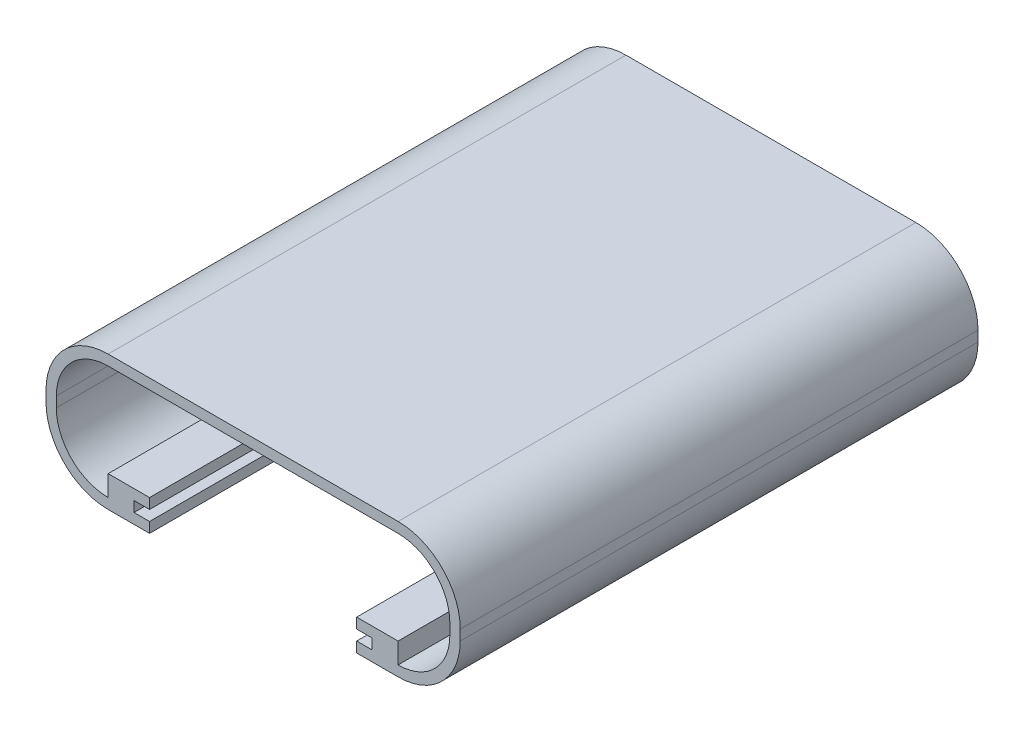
from build123d import *

# Parameters (mm, degrees)
BOSS_EXTRU_1_DEPTH = 50


with BuildPart() as part:
    # Esquisse1 → Boss.-Extru.1 (new body)
    with BuildSketch(Plane.XY):
        with BuildLine():
            Line((-21.316033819, 1), (-21.316033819, 0))
            Line((-21.316033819, 0), (-19.816033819, 0))
            Line((-19.816033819, 0), (-19.816033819, -1))
            Line((-19.816033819, -1), (-23.816033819, -1))
            ThreePointArc((-23.816033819, -1), (-28.058674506, 0.757359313), (-29.816033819, 5))
            Line((-29.816033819, 5), (-29.816033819, 6))
            ThreePointArc((-29.816033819, 6), (-28.058674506, 10.242640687), (-23.816033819, 12))
            Line((-23.816033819, 12), (4.183966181, 12))
            ThreePointArc((4.183966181, 12), (8.426606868, 10.242640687), (10.183966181, 6))
            Line((10.183966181, 6), (10.183966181, 5))
            ThreePointArc((10.183966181, 5), (8.426606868, 0.757359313), (4.183966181, -1))
            Line((4.183966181, -1), (0.183966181, -1))
            Line((0.183966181, -1), (0.183966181, 0))
            Line((0.183966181, 0), (1.683966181, 0))
            Line((1.683966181, 0), (1.683966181, 1))
            Line((1.683966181, 1), (0.183966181, 1))
            Line((0.183966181, 1), (0.183966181, 2))
            Line((0.183966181, 2), (4.183966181, 2))
            Line((4.183966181, 2), (4.183966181, 0))
            ThreePointArc((4.183966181, 0), (7.719500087, 1.464466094), (9.183966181, 5))
            Line((9.183966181, 5), (9.183966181, 6))
            ThreePointArc((9.183966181, 6), (7.719500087, 9.535533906), (4.183966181, 11))
            Line((4.183966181, 11), (-23.816033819, 11))
            ThreePointArc((-23.816033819, 11), (-27.351567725, 9.535533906), (-28.816033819, 6))
            Line((-28.816033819, 6), (-28.816033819, 5))
            ThreePointArc((-28.816033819, 5), (-27.351567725, 1.464466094), (-23.816033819, 0))
            Line((-23.816033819, 0), (-23.816033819, 2))
            Line((-23.816033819, 2), (-19.816033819, 2))
            Line((-19.816033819, 2), (-19.816033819, 1))
            Line((-19.816033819, 1), (-21.316033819, 1))
        make_face()
    extrude(amount=BOSS_EXTRU_1_DEPTH)


solid = part.part
